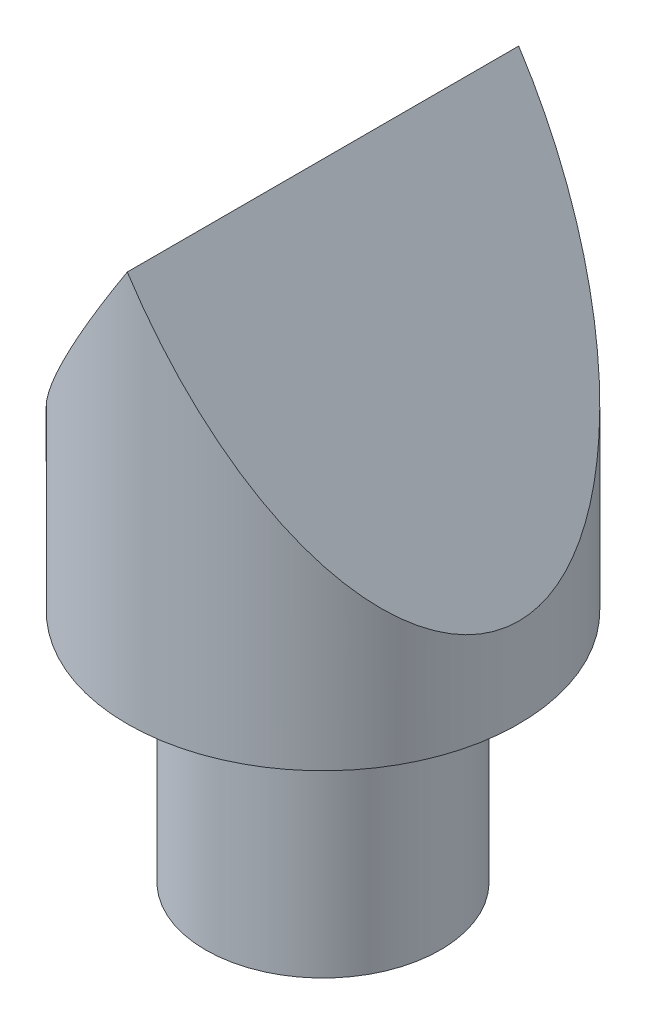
from build123d import *

# Parameters (mm, degrees)
SKETCH_1_R          = 25
EXTRUDE_1_DEPTH     = 50
SKETCH_2_R          = 15
EXTRUDE_2_DEPTH     = 30
CUT_EXTRUDE_5_DEPTH = 40
CUT_EXTRUDE_6_DEPTH = 40


with BuildPart() as part:
    # Sketch 1 → Extrude 1 (new body)
    with BuildSketch(Plane(origin=(0, 0, 0), x_dir=(1, 0, 0), z_dir=(0, 1, 0))):
        with Locations(Location((0, 0, 0), (0, 0, 270))):
            Circle(SKETCH_1_R)
    extrude(amount=EXTRUDE_1_DEPTH)

    # Sketch 2 → Extrude 2 (add)
    with BuildSketch(Plane(origin=(0, 0, 0), x_dir=(1, 0, 0), z_dir=(0, 1, 0))):
        with Locations(Location((0, 0, 0), (0, 0, 270))):
            Circle(SKETCH_2_R)
    extrude(amount=-EXTRUDE_2_DEPTH)

    # Sketch 5 → Cut-Extrude 5 (cut, symmetric)
    with BuildSketch(Plane.XY):
        Polygon((0, 50), (-25, 11.374499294), (-25, 50), align=None)
    extrude(amount=CUT_EXTRUDE_5_DEPTH, both=True, mode=Mode.SUBTRACT)

    # Sketch 7 → Cut-Extrude 6 (cut, symmetric)
    with BuildSketch(Plane.XY):
        Polygon((0, 50), (25, 50), (25, 11.374499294), align=None)
    extrude(amount=CUT_EXTRUDE_6_DEPTH, both=True, mode=Mode.SUBTRACT)


solid = part.part
